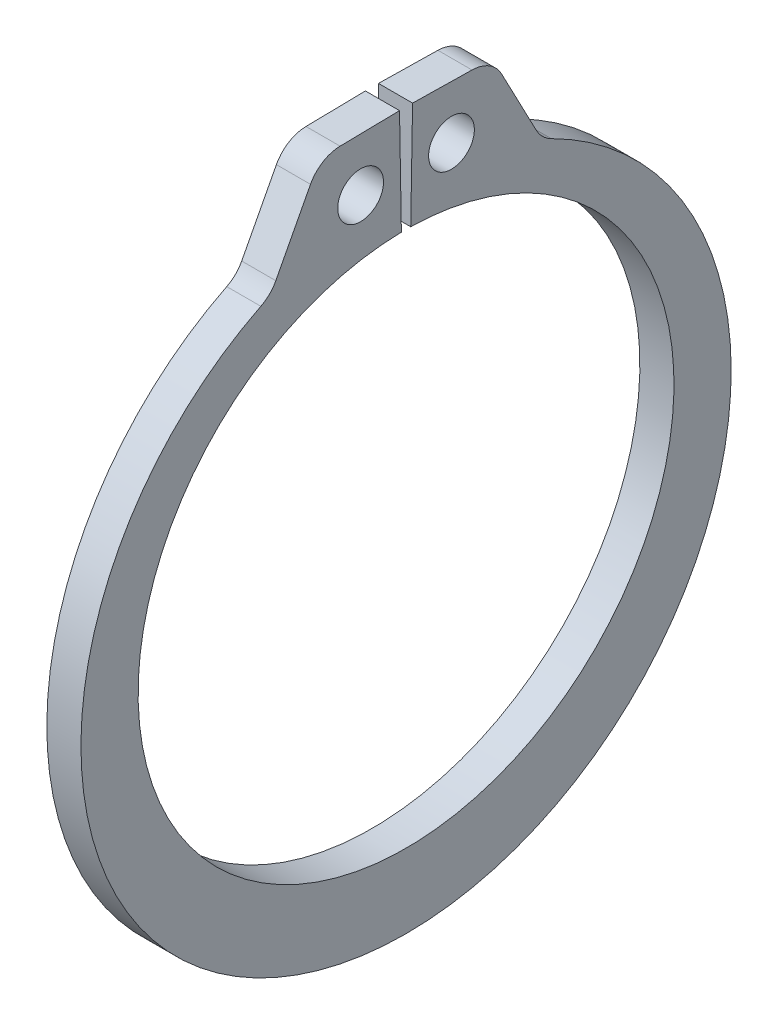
ISO-10303-21;
HEADER;
FILE_DESCRIPTION(('STEP AP214'),'2;1');
FILE_NAME('part.step','',(''),(''),'','','');
FILE_SCHEMA(('AUTOMOTIVE_DESIGN { 1 0 10303 214 1 1 1 1 }'));
ENDSEC;
DATA;
#1=APPLICATION_CONTEXT('core data for automotive mechanical design processes');
#2=APPLICATION_PROTOCOL_DEFINITION('international standard','automotive_design',2000,#1);
#3=PRODUCT_CONTEXT('',#1,'mechanical');
#4=PRODUCT('Part','Part','',(#3));
#5=PRODUCT_RELATED_PRODUCT_CATEGORY('part','',(#4));
#6=PRODUCT_DEFINITION_FORMATION('','',#4);
#7=PRODUCT_DEFINITION_CONTEXT('part definition',#1,'design');
#8=PRODUCT_DEFINITION('design','',#6,#7);
#9=PRODUCT_DEFINITION_SHAPE('','',#8);
#10=(LENGTH_UNIT() NAMED_UNIT(*) SI_UNIT(.MILLI.,.METRE.));
#11=(NAMED_UNIT(*) PLANE_ANGLE_UNIT() SI_UNIT($,.RADIAN.));
#12=(NAMED_UNIT(*) SI_UNIT($,.STERADIAN.) SOLID_ANGLE_UNIT());
#13=UNCERTAINTY_MEASURE_WITH_UNIT(LENGTH_MEASURE(1.E-05),#10,'distance_accuracy_value','');
#14=(GEOMETRIC_REPRESENTATION_CONTEXT(3) GLOBAL_UNCERTAINTY_ASSIGNED_CONTEXT((#13)) GLOBAL_UNIT_ASSIGNED_CONTEXT((#10,
#11,#12)) REPRESENTATION_CONTEXT('',''));
#15=CARTESIAN_POINT('',(0.,0.,0.));
#16=DIRECTION('',(0.,0.,1.));
#17=DIRECTION('',(1.,0.,0.));
#18=AXIS2_PLACEMENT_3D('',#15,#16,#17);
#19=CARTESIAN_POINT('',(0.4445,0.,0.));
#20=DIRECTION('',(1.,0.,0.));
#21=DIRECTION('',(0.,0.,-1.));
#22=AXIS2_PLACEMENT_3D('',#19,#20,#21);
#23=PLANE('',#22);
#24=CARTESIAN_POINT('',(0.4445,8.34990579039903,1.1841312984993));
#25=DIRECTION('',(1.,0.,0.));
#26=DIRECTION('',(0.,0.,-1.));
#27=AXIS2_PLACEMENT_3D('',#24,#25,#26);
#28=CIRCLE('',#27,0.5969);
#29=CARTESIAN_POINT('',(0.4445,8.34990579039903,0.587231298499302));
#30=VERTEX_POINT('',#29);
#31=EDGE_CURVE('E250',#30,#30,#28,.T.);
#32=ORIENTED_EDGE('',*,*,#31,.F.);
#33=EDGE_LOOP('',(#32));
#34=FACE_BOUND('',#33,.T.);
#35=DIRECTION('',(0.,-0.0174524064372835,0.999847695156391));
#36=VECTOR('',#35,1.);
#37=CARTESIAN_POINT('',(0.4445,9.75211447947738,0.170223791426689));
#38=LINE('',#37,#36);
#39=CARTESIAN_POINT('',(0.4445,9.75211447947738,0.170223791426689));
#40=VERTEX_POINT('',#39);
#41=CARTESIAN_POINT('',(0.4445,9.72507438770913,1.71934961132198));
#42=VERTEX_POINT('',#41);
#43=EDGE_CURVE('E149',#40,#42,#38,.T.);
#44=ORIENTED_EDGE('',*,*,#43,.T.);
#45=CARTESIAN_POINT('',(0.4445,8.8362097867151,1.70383442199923));
#46=DIRECTION('',(1.,0.,0.));
#47=DIRECTION('',(0.,0.,-1.));
#48=AXIS2_PLACEMENT_3D('',#45,#46,#47);
#49=CIRCLE('',#48,0.889);
#50=CARTESIAN_POINT('',(0.4445,9.24907771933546,2.49114698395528));
#51=VERTEX_POINT('',#50);
#52=EDGE_CURVE('E196',#42,#51,#49,.T.);
#53=ORIENTED_EDGE('',*,*,#52,.T.);
#54=DIRECTION('',(0.,-0.885615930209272,0.464418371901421));
#55=VECTOR('',#54,1.);
#56=CARTESIAN_POINT('',(0.4445,9.71587543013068,2.24635753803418));
#57=LINE('',#56,#55);
#58=CARTESIAN_POINT('',(0.4445,7.52528756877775,3.39510522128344));
#59=VERTEX_POINT('',#58);
#60=EDGE_CURVE('E241',#51,#59,#57,.T.);
#61=ORIENTED_EDGE('',*,*,#60,.T.);
#62=CARTESIAN_POINT('',(0.4445,7.93815550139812,4.18241778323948));
#63=DIRECTION('',(1.,0.,0.));
#64=DIRECTION('',(0.,0.,-1.));
#65=AXIS2_PLACEMENT_3D('',#62,#63,#64);
#66=CIRCLE('',#65,0.889);
#67=CARTESIAN_POINT('',(0.4445,7.14275384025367,3.78535708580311));
#68=VERTEX_POINT('',#67);
#69=EDGE_CURVE('E204',#59,#68,#66,.F.);
#70=ORIENTED_EDGE('',*,*,#69,.T.);
#71=CARTESIAN_POINT('',(0.4445,-0.440165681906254,0.));
#72=DIRECTION('',(1.,0.,0.));
#73=DIRECTION('',(0.,0.,-1.));
#74=AXIS2_PLACEMENT_3D('',#71,#72,#73);
#75=CIRCLE('',#74,8.47523431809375);
#76=CARTESIAN_POINT('',(0.4445,7.14275384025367,-3.78535708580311));
#77=VERTEX_POINT('',#76);
#78=EDGE_CURVE('E231',#68,#77,#75,.T.);
#79=ORIENTED_EDGE('',*,*,#78,.T.);
#80=CARTESIAN_POINT('',(0.4445,7.93815550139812,-4.18241778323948));
#81=DIRECTION('',(1.,0.,0.));
#82=DIRECTION('',(0.,0.,-1.));
#83=AXIS2_PLACEMENT_3D('',#80,#81,#82);
#84=CIRCLE('',#83,0.889);
#85=CARTESIAN_POINT('',(0.4445,7.52528756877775,-3.39510522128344));
#86=VERTEX_POINT('',#85);
#87=EDGE_CURVE('E11',#77,#86,#84,.F.);
#88=ORIENTED_EDGE('',*,*,#87,.T.);
#89=DIRECTION('',(0.,0.885615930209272,0.464418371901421));
#90=VECTOR('',#89,1.);
#91=CARTESIAN_POINT('',(0.4445,9.71587543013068,-2.24635753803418));
#92=LINE('',#91,#90);
#93=CARTESIAN_POINT('',(0.4445,9.24907771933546,-2.49114698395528));
#94=VERTEX_POINT('',#93);
#95=EDGE_CURVE('E230',#86,#94,#92,.T.);
#96=ORIENTED_EDGE('',*,*,#95,.T.);
#97=CARTESIAN_POINT('',(0.4445,8.8362097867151,-1.70383442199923));
#98=DIRECTION('',(1.,0.,0.));
#99=DIRECTION('',(0.,0.,-1.));
#100=AXIS2_PLACEMENT_3D('',#97,#98,#99);
#101=CIRCLE('',#100,0.889);
#102=CARTESIAN_POINT('',(0.4445,9.72507438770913,-1.71934961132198));
#103=VERTEX_POINT('',#102);
#104=EDGE_CURVE('E57',#94,#103,#101,.T.);
#105=ORIENTED_EDGE('',*,*,#104,.T.);
#106=DIRECTION('',(0.,0.0174524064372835,0.999847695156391));
#107=VECTOR('',#106,1.);
#108=CARTESIAN_POINT('',(0.4445,9.75211447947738,-0.170223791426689));
#109=LINE('',#108,#107);
#110=CARTESIAN_POINT('',(0.4445,9.75211447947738,-0.170223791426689));
#111=VERTEX_POINT('',#110);
#112=EDGE_CURVE('E236',#103,#111,#109,.T.);
#113=ORIENTED_EDGE('',*,*,#112,.T.);
#114=DIRECTION('',(0.,-0.999847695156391,0.0174524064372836));
#115=VECTOR('',#114,1.);
#116=CARTESIAN_POINT('',(0.4445,6.98393615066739,-0.121905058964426));
#117=LINE('',#116,#115);
#118=CARTESIAN_POINT('',(0.4445,6.98393615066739,-0.121905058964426));
#119=VERTEX_POINT('',#118);
#120=EDGE_CURVE('E155',#111,#119,#117,.T.);
#121=ORIENTED_EDGE('',*,*,#120,.T.);
#122=CARTESIAN_POINT('',(0.4445,0.,0.));
#123=DIRECTION('',(-1.,0.,0.));
#124=DIRECTION('',(0.,0.,-1.));
#125=AXIS2_PLACEMENT_3D('',#122,#123,#124);
#126=CIRCLE('',#125,6.985);
#127=CARTESIAN_POINT('',(0.4445,6.98393615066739,0.121905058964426));
#128=VERTEX_POINT('',#127);
#129=EDGE_CURVE('E150',#119,#128,#126,.T.);
#130=ORIENTED_EDGE('',*,*,#129,.T.);
#131=DIRECTION('',(0.,0.999847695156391,0.0174524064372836));
#132=VECTOR('',#131,1.);
#133=CARTESIAN_POINT('',(0.4445,6.98393615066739,0.121905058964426));
#134=LINE('',#133,#132);
#135=EDGE_CURVE('E141',#128,#40,#134,.T.);
#136=ORIENTED_EDGE('',*,*,#135,.T.);
#137=EDGE_LOOP('',(#44,#53,#61,#70,#79,#88,#96,#105,#113,#121,#130,#136));
#138=FACE_BOUND('',#137,.T.);
#139=CARTESIAN_POINT('',(0.4445,8.34990579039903,-1.1841312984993));
#140=DIRECTION('',(1.,0.,0.));
#141=DIRECTION('',(0.,0.,-1.));
#142=AXIS2_PLACEMENT_3D('',#139,#140,#141);
#143=CIRCLE('',#142,0.5969);
#144=CARTESIAN_POINT('',(0.4445,8.34990579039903,-1.7810312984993));
#145=VERTEX_POINT('',#144);
#146=EDGE_CURVE('E280',#145,#145,#143,.T.);
#147=ORIENTED_EDGE('',*,*,#146,.F.);
#148=EDGE_LOOP('',(#147));
#149=FACE_BOUND('',#148,.T.);
#150=ADVANCED_FACE('F41',(#34,#138,#149),#23,.T.);
#151=CARTESIAN_POINT('',(-0.4445,0.,0.));
#152=DIRECTION('',(1.,0.,0.));
#153=DIRECTION('',(0.,0.,-1.));
#154=AXIS2_PLACEMENT_3D('',#151,#152,#153);
#155=PLANE('',#154);
#156=CARTESIAN_POINT('',(-0.4445,8.34990579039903,1.1841312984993));
#157=DIRECTION('',(1.,0.,0.));
#158=DIRECTION('',(0.,0.,-1.));
#159=AXIS2_PLACEMENT_3D('',#156,#157,#158);
#160=CIRCLE('',#159,0.5969);
#161=CARTESIAN_POINT('',(-0.4445,8.34990579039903,0.587231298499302));
#162=VERTEX_POINT('',#161);
#163=EDGE_CURVE('E277',#162,#162,#160,.T.);
#164=ORIENTED_EDGE('',*,*,#163,.T.);
#165=EDGE_LOOP('',(#164));
#166=FACE_BOUND('',#165,.T.);
#167=DIRECTION('',(0.,-0.885615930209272,0.464418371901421));
#168=VECTOR('',#167,1.);
#169=CARTESIAN_POINT('',(-0.4445,9.71587543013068,2.24635753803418));
#170=LINE('',#169,#168);
#171=CARTESIAN_POINT('',(-0.4445,9.24907771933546,2.49114698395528));
#172=VERTEX_POINT('',#171);
#173=CARTESIAN_POINT('',(-0.4445,7.52528756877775,3.39510522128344));
#174=VERTEX_POINT('',#173);
#175=EDGE_CURVE('E225',#172,#174,#170,.T.);
#176=ORIENTED_EDGE('',*,*,#175,.F.);
#177=CARTESIAN_POINT('',(-0.4445,8.8362097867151,1.70383442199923));
#178=DIRECTION('',(1.,0.,0.));
#179=DIRECTION('',(0.,0.,-1.));
#180=AXIS2_PLACEMENT_3D('',#177,#178,#179);
#181=CIRCLE('',#180,0.889);
#182=CARTESIAN_POINT('',(-0.4445,9.72507438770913,1.71934961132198));
#183=VERTEX_POINT('',#182);
#184=EDGE_CURVE('E191',#172,#183,#181,.F.);
#185=ORIENTED_EDGE('',*,*,#184,.T.);
#186=DIRECTION('',(0.,-0.0174524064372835,0.999847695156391));
#187=VECTOR('',#186,1.);
#188=CARTESIAN_POINT('',(-0.4445,9.75211447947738,0.170223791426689));
#189=LINE('',#188,#187);
#190=CARTESIAN_POINT('',(-0.4445,9.75211447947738,0.170223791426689));
#191=VERTEX_POINT('',#190);
#192=EDGE_CURVE('E252',#191,#183,#189,.T.);
#193=ORIENTED_EDGE('',*,*,#192,.F.);
#194=DIRECTION('',(0.,0.999847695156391,0.0174524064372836));
#195=VECTOR('',#194,1.);
#196=CARTESIAN_POINT('',(-0.4445,6.98393615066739,0.121905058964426));
#197=LINE('',#196,#195);
#198=CARTESIAN_POINT('',(-0.4445,6.98393615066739,0.121905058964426));
#199=VERTEX_POINT('',#198);
#200=EDGE_CURVE('E249',#199,#191,#197,.T.);
#201=ORIENTED_EDGE('',*,*,#200,.F.);
#202=CARTESIAN_POINT('',(-0.4445,0.,0.));
#203=DIRECTION('',(-1.,0.,0.));
#204=DIRECTION('',(0.,0.,-1.));
#205=AXIS2_PLACEMENT_3D('',#202,#203,#204);
#206=CIRCLE('',#205,6.985);
#207=CARTESIAN_POINT('',(-0.4445,6.98393615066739,-0.121905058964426));
#208=VERTEX_POINT('',#207);
#209=EDGE_CURVE('E164',#208,#199,#206,.T.);
#210=ORIENTED_EDGE('',*,*,#209,.F.);
#211=DIRECTION('',(0.,-0.999847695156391,0.0174524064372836));
#212=VECTOR('',#211,1.);
#213=CARTESIAN_POINT('',(-0.4445,6.98393615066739,-0.121905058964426));
#214=LINE('',#213,#212);
#215=CARTESIAN_POINT('',(-0.4445,9.75211447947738,-0.170223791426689));
#216=VERTEX_POINT('',#215);
#217=EDGE_CURVE('E160',#216,#208,#214,.T.);
#218=ORIENTED_EDGE('',*,*,#217,.F.);
#219=DIRECTION('',(0.,0.0174524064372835,0.999847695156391));
#220=VECTOR('',#219,1.);
#221=CARTESIAN_POINT('',(-0.4445,9.75211447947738,-0.170223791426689));
#222=LINE('',#221,#220);
#223=CARTESIAN_POINT('',(-0.4445,9.72507438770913,-1.71934961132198));
#224=VERTEX_POINT('',#223);
#225=EDGE_CURVE('E258',#224,#216,#222,.T.);
#226=ORIENTED_EDGE('',*,*,#225,.F.);
#227=CARTESIAN_POINT('',(-0.4445,8.8362097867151,-1.70383442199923));
#228=DIRECTION('',(1.,0.,0.));
#229=DIRECTION('',(0.,0.,-1.));
#230=AXIS2_PLACEMENT_3D('',#227,#228,#229);
#231=CIRCLE('',#230,0.889);
#232=CARTESIAN_POINT('',(-0.4445,9.24907771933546,-2.49114698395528));
#233=VERTEX_POINT('',#232);
#234=EDGE_CURVE('E188',#224,#233,#231,.F.);
#235=ORIENTED_EDGE('',*,*,#234,.T.);
#236=DIRECTION('',(0.,0.885615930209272,0.464418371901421));
#237=VECTOR('',#236,1.);
#238=CARTESIAN_POINT('',(-0.4445,9.71587543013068,-2.24635753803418));
#239=LINE('',#238,#237);
#240=CARTESIAN_POINT('',(-0.4445,7.52528756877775,-3.39510522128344));
#241=VERTEX_POINT('',#240);
#242=EDGE_CURVE('E215',#241,#233,#239,.T.);
#243=ORIENTED_EDGE('',*,*,#242,.F.);
#244=CARTESIAN_POINT('',(-0.4445,7.93815550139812,-4.18241778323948));
#245=DIRECTION('',(1.,0.,0.));
#246=DIRECTION('',(0.,0.,-1.));
#247=AXIS2_PLACEMENT_3D('',#244,#245,#246);
#248=CIRCLE('',#247,0.889);
#249=CARTESIAN_POINT('',(-0.4445,7.14275384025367,-3.78535708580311));
#250=VERTEX_POINT('',#249);
#251=EDGE_CURVE('E50',#241,#250,#248,.T.);
#252=ORIENTED_EDGE('',*,*,#251,.T.);
#253=CARTESIAN_POINT('',(-0.4445,-0.440165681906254,0.));
#254=DIRECTION('',(1.,0.,0.));
#255=DIRECTION('',(0.,0.,-1.));
#256=AXIS2_PLACEMENT_3D('',#253,#254,#255);
#257=CIRCLE('',#256,8.47523431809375);
#258=CARTESIAN_POINT('',(-0.4445,7.14275384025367,3.78535708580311));
#259=VERTEX_POINT('',#258);
#260=EDGE_CURVE('E213',#259,#250,#257,.T.);
#261=ORIENTED_EDGE('',*,*,#260,.F.);
#262=CARTESIAN_POINT('',(-0.4445,7.93815550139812,4.18241778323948));
#263=DIRECTION('',(1.,0.,0.));
#264=DIRECTION('',(0.,0.,-1.));
#265=AXIS2_PLACEMENT_3D('',#262,#263,#264);
#266=CIRCLE('',#265,0.889);
#267=EDGE_CURVE('E202',#259,#174,#266,.T.);
#268=ORIENTED_EDGE('',*,*,#267,.T.);
#269=EDGE_LOOP('',(#176,#185,#193,#201,#210,#218,#226,#235,#243,#252,#261,#268));
#270=FACE_BOUND('',#269,.T.);
#271=CARTESIAN_POINT('',(-0.4445,8.34990579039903,-1.1841312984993));
#272=DIRECTION('',(1.,0.,0.));
#273=DIRECTION('',(0.,0.,-1.));
#274=AXIS2_PLACEMENT_3D('',#271,#272,#273);
#275=CIRCLE('',#274,0.5969);
#276=CARTESIAN_POINT('',(-0.4445,8.34990579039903,-1.7810312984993));
#277=VERTEX_POINT('',#276);
#278=EDGE_CURVE('E283',#277,#277,#275,.T.);
#279=ORIENTED_EDGE('',*,*,#278,.T.);
#280=EDGE_LOOP('',(#279));
#281=FACE_BOUND('',#280,.T.);
#282=ADVANCED_FACE('F211',(#166,#270,#281),#155,.F.);
#283=CARTESIAN_POINT('',(0.4445,0.,0.));
#284=DIRECTION('',(-1.,0.,0.));
#285=DIRECTION('',(0.,0.,1.));
#286=AXIS2_PLACEMENT_3D('',#283,#284,#285);
#287=CYLINDRICAL_SURFACE('',#286,6.985);
#288=ORIENTED_EDGE('',*,*,#209,.T.);
#289=DIRECTION('',(-1.,0.,0.));
#290=VECTOR('',#289,1.);
#291=CARTESIAN_POINT('',(0.4445,6.98393615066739,0.121905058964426));
#292=LINE('',#291,#290);
#293=EDGE_CURVE('E145',#128,#199,#292,.T.);
#294=ORIENTED_EDGE('',*,*,#293,.F.);
#295=ORIENTED_EDGE('',*,*,#129,.F.);
#296=DIRECTION('',(-1.,0.,0.));
#297=VECTOR('',#296,1.);
#298=CARTESIAN_POINT('',(0.4445,6.98393615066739,-0.121905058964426));
#299=LINE('',#298,#297);
#300=EDGE_CURVE('E246',#119,#208,#299,.T.);
#301=ORIENTED_EDGE('',*,*,#300,.T.);
#302=EDGE_LOOP('',(#288,#294,#295,#301));
#303=FACE_BOUND('',#302,.T.);
#304=ADVANCED_FACE('F162',(#303),#287,.F.);
#305=CARTESIAN_POINT('',(0.4445,6.98393615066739,0.121905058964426));
#306=DIRECTION('',(0.,-0.0174524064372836,0.999847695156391));
#307=DIRECTION('',(0.,-0.999847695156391,-0.0174524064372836));
#308=AXIS2_PLACEMENT_3D('',#305,#306,#307);
#309=PLANE('',#308);
#310=ORIENTED_EDGE('',*,*,#200,.T.);
#311=DIRECTION('',(-1.,0.,0.));
#312=VECTOR('',#311,1.);
#313=CARTESIAN_POINT('',(0.4445,9.75211447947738,0.170223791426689));
#314=LINE('',#313,#312);
#315=EDGE_CURVE('E148',#40,#191,#314,.T.);
#316=ORIENTED_EDGE('',*,*,#315,.F.);
#317=ORIENTED_EDGE('',*,*,#135,.F.);
#318=ORIENTED_EDGE('',*,*,#293,.T.);
#319=EDGE_LOOP('',(#310,#316,#317,#318));
#320=FACE_BOUND('',#319,.T.);
#321=ADVANCED_FACE('F143',(#320),#309,.F.);
#322=CARTESIAN_POINT('',(0.4445,9.75211447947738,0.170223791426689));
#323=DIRECTION('',(0.,-0.999847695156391,-0.0174524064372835));
#324=DIRECTION('',(0.,0.0174524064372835,-0.999847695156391));
#325=AXIS2_PLACEMENT_3D('',#322,#323,#324);
#326=PLANE('',#325);
#327=ORIENTED_EDGE('',*,*,#192,.T.);
#328=DIRECTION('',(-1.,0.,0.));
#329=VECTOR('',#328,1.);
#330=CARTESIAN_POINT('',(0.4445,9.72507438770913,1.71934961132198));
#331=LINE('',#330,#329);
#332=EDGE_CURVE('E65',#183,#42,#331,.F.);
#333=ORIENTED_EDGE('',*,*,#332,.T.);
#334=ORIENTED_EDGE('',*,*,#43,.F.);
#335=ORIENTED_EDGE('',*,*,#315,.T.);
#336=EDGE_LOOP('',(#327,#333,#334,#335));
#337=FACE_BOUND('',#336,.T.);
#338=ADVANCED_FACE('F272',(#337),#326,.F.);
#339=CARTESIAN_POINT('',(0.4445,9.71587543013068,2.24635753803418));
#340=DIRECTION('',(0.,-0.464418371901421,-0.885615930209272));
#341=DIRECTION('',(0.,0.885615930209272,-0.464418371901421));
#342=AXIS2_PLACEMENT_3D('',#339,#340,#341);
#343=PLANE('',#342);
#344=ORIENTED_EDGE('',*,*,#175,.T.);
#345=DIRECTION('',(1.,0.,0.));
#346=VECTOR('',#345,1.);
#347=CARTESIAN_POINT('',(0.4445,7.52528756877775,3.39510522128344));
#348=LINE('',#347,#346);
#349=EDGE_CURVE('E179',#174,#59,#348,.T.);
#350=ORIENTED_EDGE('',*,*,#349,.T.);
#351=ORIENTED_EDGE('',*,*,#60,.F.);
#352=DIRECTION('',(-1.,0.,0.));
#353=VECTOR('',#352,1.);
#354=CARTESIAN_POINT('',(0.4445,9.24907771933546,2.49114698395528));
#355=LINE('',#354,#353);
#356=EDGE_CURVE('E176',#51,#172,#355,.T.);
#357=ORIENTED_EDGE('',*,*,#356,.T.);
#358=EDGE_LOOP('',(#344,#350,#351,#357));
#359=FACE_BOUND('',#358,.T.);
#360=ADVANCED_FACE('F313',(#359),#343,.F.);
#361=CARTESIAN_POINT('',(0.4445,-0.440165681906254,0.));
#362=DIRECTION('',(-1.,0.,0.));
#363=DIRECTION('',(0.,0.,1.));
#364=AXIS2_PLACEMENT_3D('',#361,#362,#363);
#365=CYLINDRICAL_SURFACE('',#364,8.47523431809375);
#366=ORIENTED_EDGE('',*,*,#78,.F.);
#367=DIRECTION('',(-1.,0.,0.));
#368=VECTOR('',#367,1.);
#369=CARTESIAN_POINT('',(0.4445,7.14275384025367,3.78535708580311));
#370=LINE('',#369,#368);
#371=EDGE_CURVE('E168',#68,#259,#370,.T.);
#372=ORIENTED_EDGE('',*,*,#371,.T.);
#373=ORIENTED_EDGE('',*,*,#260,.T.);
#374=DIRECTION('',(-1.,0.,0.));
#375=VECTOR('',#374,1.);
#376=CARTESIAN_POINT('',(0.4445,7.14275384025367,-3.78535708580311));
#377=LINE('',#376,#375);
#378=EDGE_CURVE('E165',#250,#77,#377,.F.);
#379=ORIENTED_EDGE('',*,*,#378,.T.);
#380=EDGE_LOOP('',(#366,#372,#373,#379));
#381=FACE_BOUND('',#380,.T.);
#382=ADVANCED_FACE('F221',(#381),#365,.T.);
#383=CARTESIAN_POINT('',(0.4445,9.71587543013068,-2.24635753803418));
#384=DIRECTION('',(0.,-0.464418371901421,0.885615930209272));
#385=DIRECTION('',(0.,-0.885615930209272,-0.464418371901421));
#386=AXIS2_PLACEMENT_3D('',#383,#384,#385);
#387=PLANE('',#386);
#388=ORIENTED_EDGE('',*,*,#95,.F.);
#389=DIRECTION('',(1.,0.,0.));
#390=VECTOR('',#389,1.);
#391=CARTESIAN_POINT('',(-0.4445,7.52528756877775,-3.39510522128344));
#392=LINE('',#391,#390);
#393=EDGE_CURVE('E184',#86,#241,#392,.F.);
#394=ORIENTED_EDGE('',*,*,#393,.T.);
#395=ORIENTED_EDGE('',*,*,#242,.T.);
#396=DIRECTION('',(-1.,0.,0.));
#397=VECTOR('',#396,1.);
#398=CARTESIAN_POINT('',(0.4445,9.24907771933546,-2.49114698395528));
#399=LINE('',#398,#397);
#400=EDGE_CURVE('E181',#233,#94,#399,.F.);
#401=ORIENTED_EDGE('',*,*,#400,.T.);
#402=EDGE_LOOP('',(#388,#394,#395,#401));
#403=FACE_BOUND('',#402,.T.);
#404=ADVANCED_FACE('F233',(#403),#387,.F.);
#405=CARTESIAN_POINT('',(0.4445,9.75211447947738,-0.170223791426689));
#406=DIRECTION('',(0.,-0.999847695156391,0.0174524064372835));
#407=DIRECTION('',(0.,-0.0174524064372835,-0.999847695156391));
#408=AXIS2_PLACEMENT_3D('',#405,#406,#407);
#409=PLANE('',#408);
#410=ORIENTED_EDGE('',*,*,#112,.F.);
#411=DIRECTION('',(-1.,0.,0.));
#412=VECTOR('',#411,1.);
#413=CARTESIAN_POINT('',(0.4445,9.72507438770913,-1.71934961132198));
#414=LINE('',#413,#412);
#415=EDGE_CURVE('E198',#103,#224,#414,.T.);
#416=ORIENTED_EDGE('',*,*,#415,.T.);
#417=ORIENTED_EDGE('',*,*,#225,.T.);
#418=DIRECTION('',(-1.,0.,0.));
#419=VECTOR('',#418,1.);
#420=CARTESIAN_POINT('',(0.4445,9.75211447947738,-0.170223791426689));
#421=LINE('',#420,#419);
#422=EDGE_CURVE('E170',#111,#216,#421,.T.);
#423=ORIENTED_EDGE('',*,*,#422,.F.);
#424=EDGE_LOOP('',(#410,#416,#417,#423));
#425=FACE_BOUND('',#424,.T.);
#426=ADVANCED_FACE('F306',(#425),#409,.F.);
#427=CARTESIAN_POINT('',(0.4445,6.98393615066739,-0.121905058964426));
#428=DIRECTION('',(0.,-0.0174524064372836,-0.999847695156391));
#429=DIRECTION('',(0.,0.999847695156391,-0.0174524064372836));
#430=AXIS2_PLACEMENT_3D('',#427,#428,#429);
#431=PLANE('',#430);
#432=ORIENTED_EDGE('',*,*,#217,.T.);
#433=ORIENTED_EDGE('',*,*,#300,.F.);
#434=ORIENTED_EDGE('',*,*,#120,.F.);
#435=ORIENTED_EDGE('',*,*,#422,.T.);
#436=EDGE_LOOP('',(#432,#433,#434,#435));
#437=FACE_BOUND('',#436,.T.);
#438=ADVANCED_FACE('F268',(#437),#431,.F.);
#439=CARTESIAN_POINT('',(0.4445,8.34990579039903,1.1841312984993));
#440=DIRECTION('',(-1.,0.,0.));
#441=DIRECTION('',(0.,0.,1.));
#442=AXIS2_PLACEMENT_3D('',#439,#440,#441);
#443=CYLINDRICAL_SURFACE('',#442,0.5969);
#444=ORIENTED_EDGE('',*,*,#31,.T.);
#445=EDGE_LOOP('',(#444));
#446=FACE_BOUND('',#445,.T.);
#447=ORIENTED_EDGE('',*,*,#163,.F.);
#448=EDGE_LOOP('',(#447));
#449=FACE_BOUND('',#448,.T.);
#450=ADVANCED_FACE('F301',(#446,#449),#443,.F.);
#451=CARTESIAN_POINT('',(0.4445,8.34990579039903,-1.1841312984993));
#452=DIRECTION('',(-1.,0.,0.));
#453=DIRECTION('',(0.,0.,1.));
#454=AXIS2_PLACEMENT_3D('',#451,#452,#453);
#455=CYLINDRICAL_SURFACE('',#454,0.5969);
#456=ORIENTED_EDGE('',*,*,#146,.T.);
#457=EDGE_LOOP('',(#456));
#458=FACE_BOUND('',#457,.T.);
#459=ORIENTED_EDGE('',*,*,#278,.F.);
#460=EDGE_LOOP('',(#459));
#461=FACE_BOUND('',#460,.T.);
#462=ADVANCED_FACE('F289',(#458,#461),#455,.F.);
#463=CARTESIAN_POINT('',(0.4445,7.93815550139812,4.18241778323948));
#464=DIRECTION('',(-1.,0.,0.));
#465=DIRECTION('',(0.,0.,1.));
#466=AXIS2_PLACEMENT_3D('',#463,#464,#465);
#467=CYLINDRICAL_SURFACE('',#466,0.889);
#468=ORIENTED_EDGE('',*,*,#69,.F.);
#469=ORIENTED_EDGE('',*,*,#349,.F.);
#470=ORIENTED_EDGE('',*,*,#267,.F.);
#471=ORIENTED_EDGE('',*,*,#371,.F.);
#472=EDGE_LOOP('',(#468,#469,#470,#471));
#473=FACE_BOUND('',#472,.T.);
#474=ADVANCED_FACE('F323',(#473),#467,.F.);
#475=CARTESIAN_POINT('',(0.4445,7.93815550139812,-4.18241778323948));
#476=DIRECTION('',(-1.,0.,0.));
#477=DIRECTION('',(0.,0.,1.));
#478=AXIS2_PLACEMENT_3D('',#475,#476,#477);
#479=CYLINDRICAL_SURFACE('',#478,0.889);
#480=ORIENTED_EDGE('',*,*,#87,.F.);
#481=ORIENTED_EDGE('',*,*,#378,.F.);
#482=ORIENTED_EDGE('',*,*,#251,.F.);
#483=ORIENTED_EDGE('',*,*,#393,.F.);
#484=EDGE_LOOP('',(#480,#481,#482,#483));
#485=FACE_BOUND('',#484,.T.);
#486=ADVANCED_FACE('F228',(#485),#479,.F.);
#487=CARTESIAN_POINT('',(0.4445,8.8362097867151,1.70383442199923));
#488=DIRECTION('',(-1.,0.,0.));
#489=DIRECTION('',(0.,0.,1.));
#490=AXIS2_PLACEMENT_3D('',#487,#488,#489);
#491=CYLINDRICAL_SURFACE('',#490,0.889);
#492=ORIENTED_EDGE('',*,*,#52,.F.);
#493=ORIENTED_EDGE('',*,*,#332,.F.);
#494=ORIENTED_EDGE('',*,*,#184,.F.);
#495=ORIENTED_EDGE('',*,*,#356,.F.);
#496=EDGE_LOOP('',(#492,#493,#494,#495));
#497=FACE_BOUND('',#496,.T.);
#498=ADVANCED_FACE('F328',(#497),#491,.T.);
#499=CARTESIAN_POINT('',(0.4445,8.8362097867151,-1.70383442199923));
#500=DIRECTION('',(-1.,0.,0.));
#501=DIRECTION('',(0.,0.,1.));
#502=AXIS2_PLACEMENT_3D('',#499,#500,#501);
#503=CYLINDRICAL_SURFACE('',#502,0.889);
#504=ORIENTED_EDGE('',*,*,#104,.F.);
#505=ORIENTED_EDGE('',*,*,#400,.F.);
#506=ORIENTED_EDGE('',*,*,#234,.F.);
#507=ORIENTED_EDGE('',*,*,#415,.F.);
#508=EDGE_LOOP('',(#504,#505,#506,#507));
#509=FACE_BOUND('',#508,.T.);
#510=ADVANCED_FACE('F43',(#509),#503,.T.);
#511=CLOSED_SHELL('',(#150,#282,#304,#321,#338,#360,#382,#404,#426,#438,#450,#462,#474,#486,
#498,#510));
#512=MANIFOLD_SOLID_BREP('B2',#511);
#513=ADVANCED_BREP_SHAPE_REPRESENTATION('',(#18,#512),#14);
#514=SHAPE_DEFINITION_REPRESENTATION(#9,#513);
ENDSEC;
END-ISO-10303-21;
